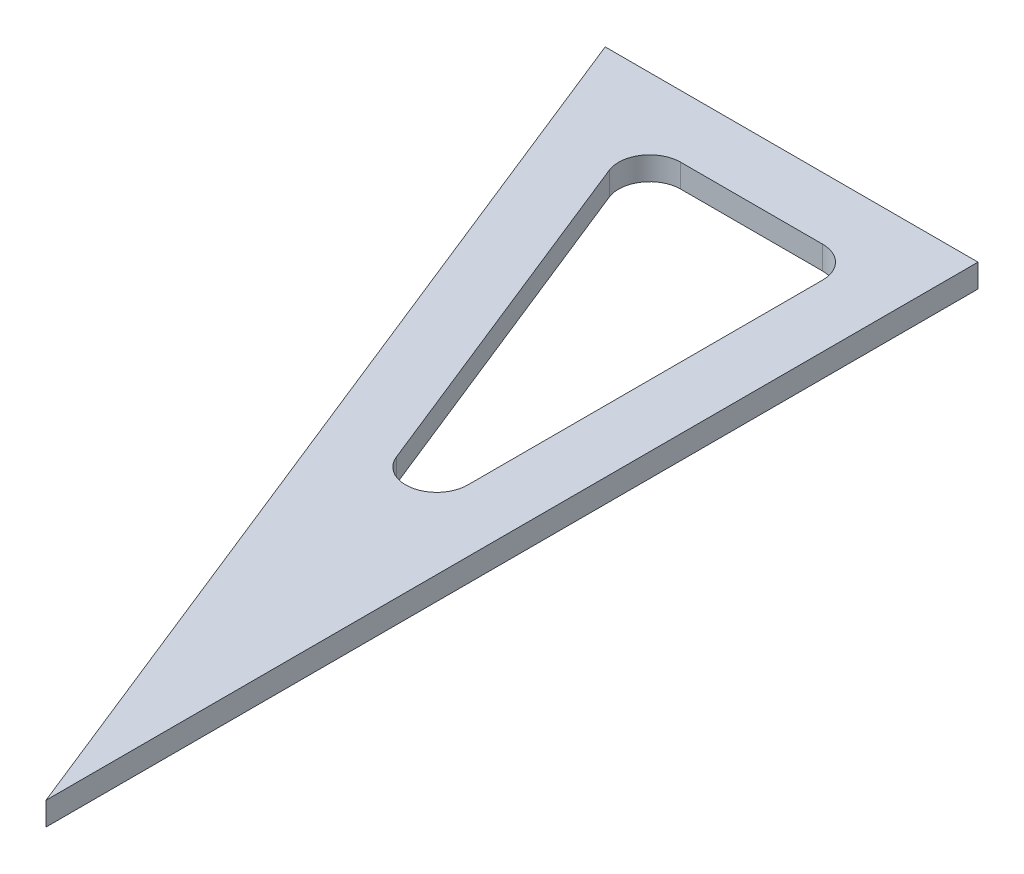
from build123d import *

# Parameters (mm, degrees)
SKETCH1_W          = 76.2
SKETCH1_H          = 4.7625
EXTRUDE1_DEPTH     = 190.5
CUT_EXTRUDE1_DEPTH = 210.707581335
FILLET1_R          = 6.35


with BuildPart() as part:
    # Sketch1 → Extrude1 (new body)
    with BuildSketch(Plane.XY):
        with Locations((-49.446206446, 216.07095853)):
            Rectangle(SKETCH1_W, SKETCH1_H)
    extrude(amount=EXTRUDE1_DEPTH)

    # Sketch2 → Cut-Extrude1 (cut, through all)
    with BuildSketch(Plane(origin=(0, 218.45220853, 0), x_dir=(1, 0, 0), z_dir=(0, 1, 0))):
        Polygon((-87.546206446, 0), (-11.346206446, -190.5), (-87.546206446, -190.5), align=None)
        Polygon((-68.787887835, -12.7), (-24.046206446, -124.554203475), (-24.046206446, -12.7), align=None)
    extrude(amount=-CUT_EXTRUDE1_DEPTH, mode=Mode.SUBTRACT)

    # Fillet1
    fillet1_edges = [part.edges().sort_by_distance(p)[0] for p in [
        (-68.787887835, 216.07095853, 12.7),
        (-24.046206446, 216.07095853, 12.7),
        (-24.046206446, 216.07095853, 124.554203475),
    ]]
    fillet(fillet1_edges, radius=FILLET1_R)


solid = part.part
